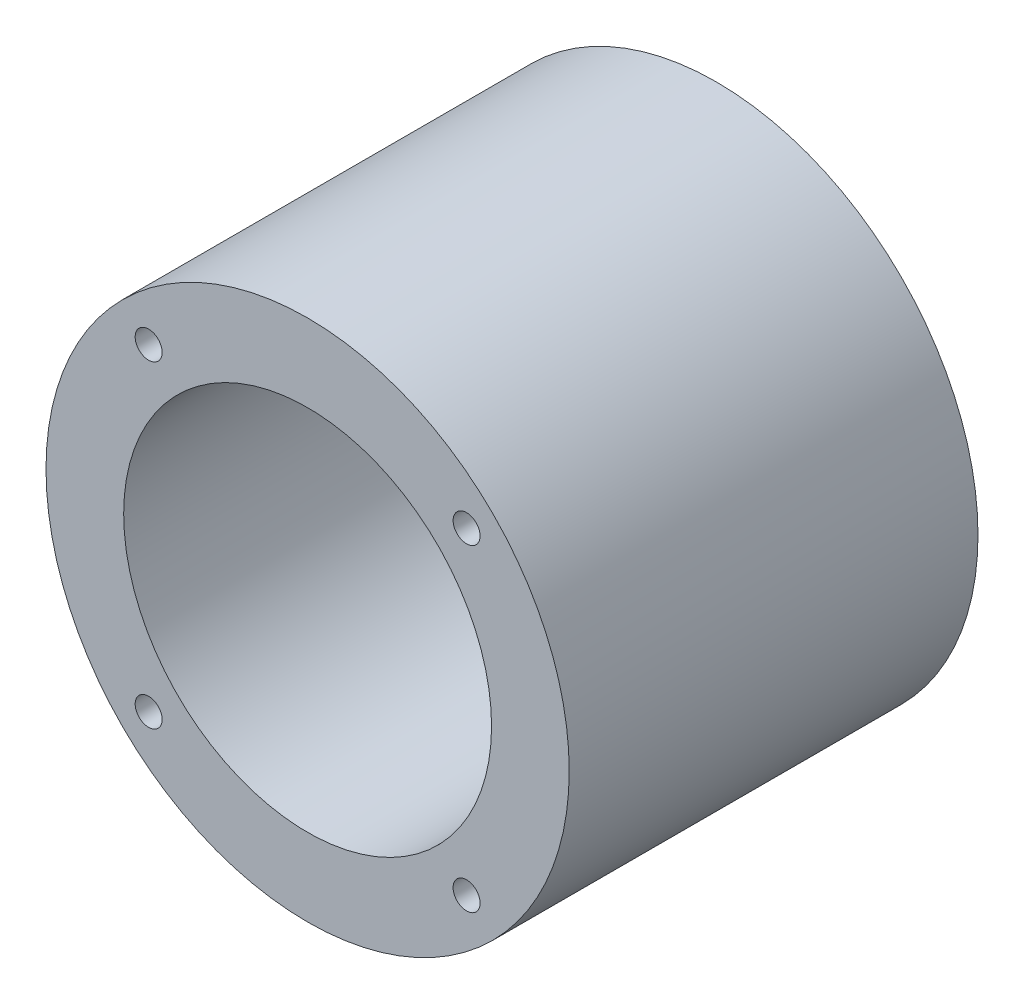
ISO-10303-21;
HEADER;
FILE_DESCRIPTION(('STEP AP214'),'2;1');
FILE_NAME('part.step','',(''),(''),'','','');
FILE_SCHEMA(('AUTOMOTIVE_DESIGN { 1 0 10303 214 1 1 1 1 }'));
ENDSEC;
DATA;
#1=APPLICATION_CONTEXT('core data for automotive mechanical design processes');
#2=APPLICATION_PROTOCOL_DEFINITION('international standard','automotive_design',2000,#1);
#3=PRODUCT_CONTEXT('',#1,'mechanical');
#4=PRODUCT('Part','Part','',(#3));
#5=PRODUCT_RELATED_PRODUCT_CATEGORY('part','',(#4));
#6=PRODUCT_DEFINITION_FORMATION('','',#4);
#7=PRODUCT_DEFINITION_CONTEXT('part definition',#1,'design');
#8=PRODUCT_DEFINITION('design','',#6,#7);
#9=PRODUCT_DEFINITION_SHAPE('','',#8);
#10=(LENGTH_UNIT() NAMED_UNIT(*) SI_UNIT(.MILLI.,.METRE.));
#11=(NAMED_UNIT(*) PLANE_ANGLE_UNIT() SI_UNIT($,.RADIAN.));
#12=(NAMED_UNIT(*) SI_UNIT($,.STERADIAN.) SOLID_ANGLE_UNIT());
#13=UNCERTAINTY_MEASURE_WITH_UNIT(LENGTH_MEASURE(1.E-05),#10,'distance_accuracy_value','');
#14=(GEOMETRIC_REPRESENTATION_CONTEXT(3) GLOBAL_UNCERTAINTY_ASSIGNED_CONTEXT((#13)) GLOBAL_UNIT_ASSIGNED_CONTEXT((#10,
#11,#12)) REPRESENTATION_CONTEXT('',''));
#15=CARTESIAN_POINT('',(0.,0.,0.));
#16=DIRECTION('',(0.,0.,1.));
#17=DIRECTION('',(1.,0.,0.));
#18=AXIS2_PLACEMENT_3D('',#15,#16,#17);
#19=CARTESIAN_POINT('',(0.,0.,100.));
#20=DIRECTION('',(0.,0.,1.));
#21=DIRECTION('',(1.,0.,0.));
#22=AXIS2_PLACEMENT_3D('',#19,#20,#21);
#23=PLANE('',#22);
#24=CARTESIAN_POINT('',(0.,0.,100.));
#25=DIRECTION('',(0.,0.,1.));
#26=DIRECTION('',(1.,0.,0.));
#27=AXIS2_PLACEMENT_3D('',#24,#25,#26);
#28=CIRCLE('',#27,45.);
#29=CARTESIAN_POINT('',(45.,0.,100.));
#30=VERTEX_POINT('',#29);
#31=EDGE_CURVE('E76',#30,#30,#28,.T.);
#32=ORIENTED_EDGE('',*,*,#31,.F.);
#33=EDGE_LOOP('',(#32));
#34=FACE_BOUND('',#33,.T.);
#35=CARTESIAN_POINT('',(-38.8908729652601,38.8908729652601,100.));
#36=DIRECTION('',(0.,0.,1.));
#37=DIRECTION('',(1.,0.,0.));
#38=AXIS2_PLACEMENT_3D('',#35,#36,#37);
#39=CIRCLE('',#38,3.29999999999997);
#40=CARTESIAN_POINT('',(-35.5908729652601,38.8908729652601,100.));
#41=VERTEX_POINT('',#40);
#42=EDGE_CURVE('E61',#41,#41,#39,.T.);
#43=ORIENTED_EDGE('',*,*,#42,.F.);
#44=EDGE_LOOP('',(#43));
#45=FACE_BOUND('',#44,.T.);
#46=CARTESIAN_POINT('',(38.8908729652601,-38.8908729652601,100.));
#47=DIRECTION('',(0.,0.,1.));
#48=DIRECTION('',(1.,0.,0.));
#49=AXIS2_PLACEMENT_3D('',#46,#47,#48);
#50=CIRCLE('',#49,3.29999999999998);
#51=CARTESIAN_POINT('',(42.1908729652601,-38.8908729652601,100.));
#52=VERTEX_POINT('',#51);
#53=EDGE_CURVE('E50',#52,#52,#50,.T.);
#54=ORIENTED_EDGE('',*,*,#53,.F.);
#55=EDGE_LOOP('',(#54));
#56=FACE_BOUND('',#55,.T.);
#57=CARTESIAN_POINT('',(0.,0.,100.));
#58=DIRECTION('',(0.,0.,1.));
#59=DIRECTION('',(1.,0.,0.));
#60=AXIS2_PLACEMENT_3D('',#57,#58,#59);
#61=CIRCLE('',#60,64.);
#62=CARTESIAN_POINT('',(64.,0.,100.));
#63=VERTEX_POINT('',#62);
#64=EDGE_CURVE('E10',#63,#63,#61,.T.);
#65=ORIENTED_EDGE('',*,*,#64,.T.);
#66=EDGE_LOOP('',(#65));
#67=FACE_BOUND('',#66,.T.);
#68=CARTESIAN_POINT('',(-38.8908729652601,-38.8908729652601,100.));
#69=DIRECTION('',(0.,0.,1.));
#70=DIRECTION('',(1.,0.,0.));
#71=AXIS2_PLACEMENT_3D('',#68,#69,#70);
#72=CIRCLE('',#71,3.29999999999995);
#73=CARTESIAN_POINT('',(-35.5908729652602,-38.8908729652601,100.));
#74=VERTEX_POINT('',#73);
#75=EDGE_CURVE('E55',#74,#74,#72,.T.);
#76=ORIENTED_EDGE('',*,*,#75,.F.);
#77=EDGE_LOOP('',(#76));
#78=FACE_BOUND('',#77,.T.);
#79=CARTESIAN_POINT('',(38.8908729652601,38.8908729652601,100.));
#80=DIRECTION('',(0.,0.,1.));
#81=DIRECTION('',(1.,0.,0.));
#82=AXIS2_PLACEMENT_3D('',#79,#80,#81);
#83=CIRCLE('',#82,3.29999999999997);
#84=CARTESIAN_POINT('',(42.1908729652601,38.8908729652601,100.));
#85=VERTEX_POINT('',#84);
#86=EDGE_CURVE('E67',#85,#85,#83,.T.);
#87=ORIENTED_EDGE('',*,*,#86,.F.);
#88=EDGE_LOOP('',(#87));
#89=FACE_BOUND('',#88,.T.);
#90=ADVANCED_FACE('F39',(#34,#45,#56,#67,#78,#89),#23,.T.);
#91=CARTESIAN_POINT('',(0.,0.,0.));
#92=DIRECTION('',(0.,0.,1.));
#93=DIRECTION('',(1.,0.,0.));
#94=AXIS2_PLACEMENT_3D('',#91,#92,#93);
#95=PLANE('',#94);
#96=CARTESIAN_POINT('',(0.,0.,0.));
#97=DIRECTION('',(0.,0.,1.));
#98=DIRECTION('',(1.,0.,0.));
#99=AXIS2_PLACEMENT_3D('',#96,#97,#98);
#100=CIRCLE('',#99,45.);
#101=CARTESIAN_POINT('',(45.,0.,0.));
#102=VERTEX_POINT('',#101);
#103=EDGE_CURVE('E73',#102,#102,#100,.T.);
#104=ORIENTED_EDGE('',*,*,#103,.T.);
#105=EDGE_LOOP('',(#104));
#106=FACE_BOUND('',#105,.T.);
#107=CARTESIAN_POINT('',(0.,0.,0.));
#108=DIRECTION('',(0.,0.,1.));
#109=DIRECTION('',(1.,0.,0.));
#110=AXIS2_PLACEMENT_3D('',#107,#108,#109);
#111=CIRCLE('',#110,64.);
#112=CARTESIAN_POINT('',(64.,0.,0.));
#113=VERTEX_POINT('',#112);
#114=EDGE_CURVE('E43',#113,#113,#111,.T.);
#115=ORIENTED_EDGE('',*,*,#114,.F.);
#116=EDGE_LOOP('',(#115));
#117=FACE_BOUND('',#116,.T.);
#118=CARTESIAN_POINT('',(38.8908729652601,-38.8908729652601,0.));
#119=DIRECTION('',(0.,0.,1.));
#120=DIRECTION('',(1.,0.,0.));
#121=AXIS2_PLACEMENT_3D('',#118,#119,#120);
#122=CIRCLE('',#121,3.29999999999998);
#123=CARTESIAN_POINT('',(42.1908729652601,-38.8908729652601,0.));
#124=VERTEX_POINT('',#123);
#125=EDGE_CURVE('E52',#124,#124,#122,.T.);
#126=ORIENTED_EDGE('',*,*,#125,.T.);
#127=EDGE_LOOP('',(#126));
#128=FACE_BOUND('',#127,.T.);
#129=CARTESIAN_POINT('',(-38.8908729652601,-38.8908729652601,0.));
#130=DIRECTION('',(0.,0.,1.));
#131=DIRECTION('',(1.,0.,0.));
#132=AXIS2_PLACEMENT_3D('',#129,#130,#131);
#133=CIRCLE('',#132,3.29999999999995);
#134=CARTESIAN_POINT('',(-35.5908729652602,-38.8908729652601,0.));
#135=VERTEX_POINT('',#134);
#136=EDGE_CURVE('E58',#135,#135,#133,.T.);
#137=ORIENTED_EDGE('',*,*,#136,.T.);
#138=EDGE_LOOP('',(#137));
#139=FACE_BOUND('',#138,.T.);
#140=CARTESIAN_POINT('',(-38.8908729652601,38.8908729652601,0.));
#141=DIRECTION('',(0.,0.,1.));
#142=DIRECTION('',(1.,0.,0.));
#143=AXIS2_PLACEMENT_3D('',#140,#141,#142);
#144=CIRCLE('',#143,3.29999999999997);
#145=CARTESIAN_POINT('',(-35.5908729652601,38.8908729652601,0.));
#146=VERTEX_POINT('',#145);
#147=EDGE_CURVE('E64',#146,#146,#144,.T.);
#148=ORIENTED_EDGE('',*,*,#147,.T.);
#149=EDGE_LOOP('',(#148));
#150=FACE_BOUND('',#149,.T.);
#151=CARTESIAN_POINT('',(38.8908729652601,38.8908729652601,0.));
#152=DIRECTION('',(0.,0.,1.));
#153=DIRECTION('',(1.,0.,0.));
#154=AXIS2_PLACEMENT_3D('',#151,#152,#153);
#155=CIRCLE('',#154,3.29999999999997);
#156=CARTESIAN_POINT('',(42.1908729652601,38.8908729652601,0.));
#157=VERTEX_POINT('',#156);
#158=EDGE_CURVE('E70',#157,#157,#155,.T.);
#159=ORIENTED_EDGE('',*,*,#158,.T.);
#160=EDGE_LOOP('',(#159));
#161=FACE_BOUND('',#160,.T.);
#162=ADVANCED_FACE('F82',(#106,#117,#128,#139,#150,#161),#95,.F.);
#163=CARTESIAN_POINT('',(0.,0.,100.));
#164=DIRECTION('',(0.,0.,-1.));
#165=DIRECTION('',(-1.,0.,0.));
#166=AXIS2_PLACEMENT_3D('',#163,#164,#165);
#167=CYLINDRICAL_SURFACE('',#166,64.);
#168=ORIENTED_EDGE('',*,*,#64,.F.);
#169=EDGE_LOOP('',(#168));
#170=FACE_BOUND('',#169,.T.);
#171=ORIENTED_EDGE('',*,*,#114,.T.);
#172=EDGE_LOOP('',(#171));
#173=FACE_BOUND('',#172,.T.);
#174=ADVANCED_FACE('F41',(#170,#173),#167,.T.);
#175=CARTESIAN_POINT('',(38.8908729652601,-38.8908729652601,100.));
#176=DIRECTION('',(0.,0.,-1.));
#177=DIRECTION('',(-1.,0.,0.));
#178=AXIS2_PLACEMENT_3D('',#175,#176,#177);
#179=CYLINDRICAL_SURFACE('',#178,3.29999999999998);
#180=ORIENTED_EDGE('',*,*,#53,.T.);
#181=EDGE_LOOP('',(#180));
#182=FACE_BOUND('',#181,.T.);
#183=ORIENTED_EDGE('',*,*,#125,.F.);
#184=EDGE_LOOP('',(#183));
#185=FACE_BOUND('',#184,.T.);
#186=ADVANCED_FACE('F113',(#182,#185),#179,.F.);
#187=CARTESIAN_POINT('',(-38.8908729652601,-38.8908729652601,100.));
#188=DIRECTION('',(0.,0.,-1.));
#189=DIRECTION('',(-1.,0.,0.));
#190=AXIS2_PLACEMENT_3D('',#187,#188,#189);
#191=CYLINDRICAL_SURFACE('',#190,3.29999999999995);
#192=ORIENTED_EDGE('',*,*,#75,.T.);
#193=EDGE_LOOP('',(#192));
#194=FACE_BOUND('',#193,.T.);
#195=ORIENTED_EDGE('',*,*,#136,.F.);
#196=EDGE_LOOP('',(#195));
#197=FACE_BOUND('',#196,.T.);
#198=ADVANCED_FACE('F118',(#194,#197),#191,.F.);
#199=CARTESIAN_POINT('',(-38.8908729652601,38.8908729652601,100.));
#200=DIRECTION('',(0.,0.,-1.));
#201=DIRECTION('',(-1.,0.,0.));
#202=AXIS2_PLACEMENT_3D('',#199,#200,#201);
#203=CYLINDRICAL_SURFACE('',#202,3.29999999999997);
#204=ORIENTED_EDGE('',*,*,#42,.T.);
#205=EDGE_LOOP('',(#204));
#206=FACE_BOUND('',#205,.T.);
#207=ORIENTED_EDGE('',*,*,#147,.F.);
#208=EDGE_LOOP('',(#207));
#209=FACE_BOUND('',#208,.T.);
#210=ADVANCED_FACE('F105',(#206,#209),#203,.F.);
#211=CARTESIAN_POINT('',(38.8908729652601,38.8908729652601,100.));
#212=DIRECTION('',(0.,0.,-1.));
#213=DIRECTION('',(-1.,0.,0.));
#214=AXIS2_PLACEMENT_3D('',#211,#212,#213);
#215=CYLINDRICAL_SURFACE('',#214,3.29999999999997);
#216=ORIENTED_EDGE('',*,*,#86,.T.);
#217=EDGE_LOOP('',(#216));
#218=FACE_BOUND('',#217,.T.);
#219=ORIENTED_EDGE('',*,*,#158,.F.);
#220=EDGE_LOOP('',(#219));
#221=FACE_BOUND('',#220,.T.);
#222=ADVANCED_FACE('F88',(#218,#221),#215,.F.);
#223=CARTESIAN_POINT('',(0.,0.,0.));
#224=DIRECTION('',(0.,0.,1.));
#225=DIRECTION('',(1.,0.,0.));
#226=AXIS2_PLACEMENT_3D('',#223,#224,#225);
#227=CYLINDRICAL_SURFACE('',#226,45.);
#228=ORIENTED_EDGE('',*,*,#103,.F.);
#229=EDGE_LOOP('',(#228));
#230=FACE_BOUND('',#229,.T.);
#231=ORIENTED_EDGE('',*,*,#31,.T.);
#232=EDGE_LOOP('',(#231));
#233=FACE_BOUND('',#232,.T.);
#234=ADVANCED_FACE('F85',(#230,#233),#227,.F.);
#235=CLOSED_SHELL('',(#90,#162,#174,#186,#198,#210,#222,#234));
#236=MANIFOLD_SOLID_BREP('B2',#235);
#237=ADVANCED_BREP_SHAPE_REPRESENTATION('',(#18,#236),#14);
#238=SHAPE_DEFINITION_REPRESENTATION(#9,#237);
ENDSEC;
END-ISO-10303-21;
